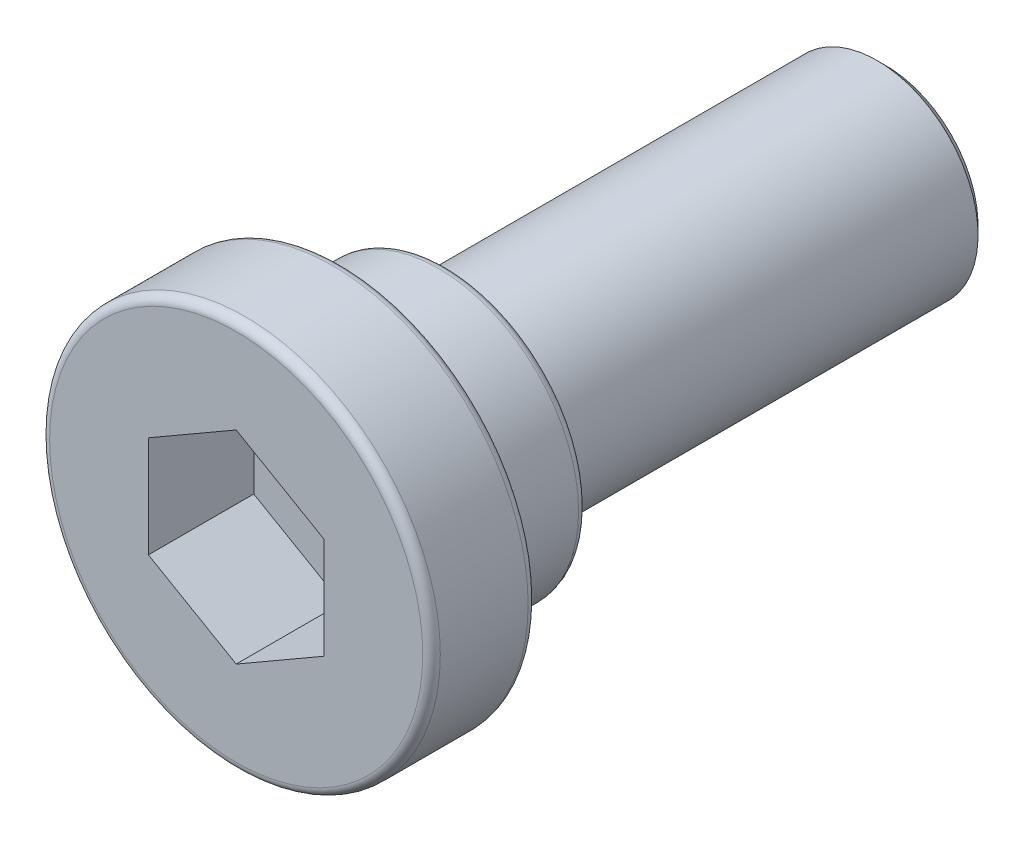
ISO-10303-21;
HEADER;
FILE_DESCRIPTION(('STEP AP214'),'2;1');
FILE_NAME('part.step','',(''),(''),'','','');
FILE_SCHEMA(('AUTOMOTIVE_DESIGN { 1 0 10303 214 1 1 1 1 }'));
ENDSEC;
DATA;
#1=APPLICATION_CONTEXT('core data for automotive mechanical design processes');
#2=APPLICATION_PROTOCOL_DEFINITION('international standard','automotive_design',2000,#1);
#3=PRODUCT_CONTEXT('',#1,'mechanical');
#4=PRODUCT('Part','Part','',(#3));
#5=PRODUCT_RELATED_PRODUCT_CATEGORY('part','',(#4));
#6=PRODUCT_DEFINITION_FORMATION('','',#4);
#7=PRODUCT_DEFINITION_CONTEXT('part definition',#1,'design');
#8=PRODUCT_DEFINITION('design','',#6,#7);
#9=PRODUCT_DEFINITION_SHAPE('','',#8);
#10=(LENGTH_UNIT() NAMED_UNIT(*) SI_UNIT(.MILLI.,.METRE.));
#11=(NAMED_UNIT(*) PLANE_ANGLE_UNIT() SI_UNIT($,.RADIAN.));
#12=(NAMED_UNIT(*) SI_UNIT($,.STERADIAN.) SOLID_ANGLE_UNIT());
#13=UNCERTAINTY_MEASURE_WITH_UNIT(LENGTH_MEASURE(1.E-05),#10,'distance_accuracy_value','');
#14=(GEOMETRIC_REPRESENTATION_CONTEXT(3) GLOBAL_UNCERTAINTY_ASSIGNED_CONTEXT((#13)) GLOBAL_UNIT_ASSIGNED_CONTEXT((#10,
#11,#12)) REPRESENTATION_CONTEXT('',''));
#15=CARTESIAN_POINT('',(0.,0.,0.));
#16=DIRECTION('',(0.,0.,1.));
#17=DIRECTION('',(1.,0.,0.));
#18=AXIS2_PLACEMENT_3D('',#15,#16,#17);
#19=CARTESIAN_POINT('',(0.,0.,6.2));
#20=DIRECTION('',(0.,0.,1.));
#21=DIRECTION('',(1.,0.,0.));
#22=AXIS2_PLACEMENT_3D('',#19,#20,#21);
#23=PLANE('',#22);
#24=DIRECTION('',(0.866025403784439,0.5,0.));
#25=VECTOR('',#24,1.);
#26=CARTESIAN_POINT('',(0.,-1.15470053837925,6.2));
#27=LINE('',#26,#25);
#28=CARTESIAN_POINT('',(0.,-1.15470053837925,6.2));
#29=VERTEX_POINT('',#28);
#30=CARTESIAN_POINT('',(1.,-0.577350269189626,6.2));
#31=VERTEX_POINT('',#30);
#32=EDGE_CURVE('E87',#29,#31,#27,.T.);
#33=ORIENTED_EDGE('',*,*,#32,.T.);
#34=DIRECTION('',(0.,1.,0.));
#35=VECTOR('',#34,1.);
#36=CARTESIAN_POINT('',(1.,-0.577350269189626,6.2));
#37=LINE('',#36,#35);
#38=CARTESIAN_POINT('',(1.,0.577350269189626,6.2));
#39=VERTEX_POINT('',#38);
#40=EDGE_CURVE('E89',#31,#39,#37,.T.);
#41=ORIENTED_EDGE('',*,*,#40,.T.);
#42=DIRECTION('',(-0.866025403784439,0.5,0.));
#43=VECTOR('',#42,1.);
#44=CARTESIAN_POINT('',(1.,0.577350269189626,6.2));
#45=LINE('',#44,#43);
#46=CARTESIAN_POINT('',(0.,1.15470053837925,6.2));
#47=VERTEX_POINT('',#46);
#48=EDGE_CURVE('E91',#39,#47,#45,.T.);
#49=ORIENTED_EDGE('',*,*,#48,.T.);
#50=DIRECTION('',(-0.866025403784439,-0.5,0.));
#51=VECTOR('',#50,1.);
#52=CARTESIAN_POINT('',(0.,1.15470053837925,6.2));
#53=LINE('',#52,#51);
#54=CARTESIAN_POINT('',(-1.,0.577350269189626,6.2));
#55=VERTEX_POINT('',#54);
#56=EDGE_CURVE('E241',#47,#55,#53,.T.);
#57=ORIENTED_EDGE('',*,*,#56,.T.);
#58=DIRECTION('',(0.,-1.,0.));
#59=VECTOR('',#58,1.);
#60=CARTESIAN_POINT('',(-1.,0.577350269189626,6.2));
#61=LINE('',#60,#59);
#62=CARTESIAN_POINT('',(-1.,-0.577350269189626,6.2));
#63=VERTEX_POINT('',#62);
#64=EDGE_CURVE('E246',#55,#63,#61,.T.);
#65=ORIENTED_EDGE('',*,*,#64,.T.);
#66=DIRECTION('',(0.866025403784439,-0.5,0.));
#67=VECTOR('',#66,1.);
#68=CARTESIAN_POINT('',(-1.,-0.577350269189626,6.2));
#69=LINE('',#68,#67);
#70=EDGE_CURVE('E250',#63,#29,#69,.T.);
#71=ORIENTED_EDGE('',*,*,#70,.T.);
#72=EDGE_LOOP('',(#33,#41,#49,#57,#65,#71));
#73=FACE_BOUND('',#72,.T.);
#74=ADVANCED_FACE('F17',(#73),#23,.T.);
#75=CARTESIAN_POINT('',(1.,0.577350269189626,6.2));
#76=DIRECTION('',(0.5,0.866025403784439,0.));
#77=DIRECTION('',(-0.866025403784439,0.5,0.));
#78=AXIS2_PLACEMENT_3D('',#75,#76,#77);
#79=PLANE('',#78);
#80=DIRECTION('',(0.,0.,1.));
#81=VECTOR('',#80,1.);
#82=CARTESIAN_POINT('',(0.,1.15470053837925,6.2));
#83=LINE('',#82,#81);
#84=CARTESIAN_POINT('',(0.,1.15470053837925,7.4));
#85=VERTEX_POINT('',#84);
#86=EDGE_CURVE('E102',#85,#47,#83,.F.);
#87=ORIENTED_EDGE('',*,*,#86,.T.);
#88=ORIENTED_EDGE('',*,*,#48,.F.);
#89=DIRECTION('',(0.,0.,1.));
#90=VECTOR('',#89,1.);
#91=CARTESIAN_POINT('',(1.,0.577350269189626,6.2));
#92=LINE('',#91,#90);
#93=CARTESIAN_POINT('',(1.,0.577350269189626,7.4));
#94=VERTEX_POINT('',#93);
#95=EDGE_CURVE('E96',#39,#94,#92,.T.);
#96=ORIENTED_EDGE('',*,*,#95,.T.);
#97=DIRECTION('',(0.866025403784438,-0.5,0.));
#98=VECTOR('',#97,1.);
#99=CARTESIAN_POINT('',(0.,1.15470053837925,7.4));
#100=LINE('',#99,#98);
#101=EDGE_CURVE('E240',#85,#94,#100,.T.);
#102=ORIENTED_EDGE('',*,*,#101,.F.);
#103=EDGE_LOOP('',(#87,#88,#96,#102));
#104=FACE_BOUND('',#103,.T.);
#105=ADVANCED_FACE('F99',(#104),#79,.F.);
#106=CARTESIAN_POINT('',(1.,-0.577350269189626,6.2));
#107=DIRECTION('',(1.,0.,0.));
#108=DIRECTION('',(0.,1.,0.));
#109=AXIS2_PLACEMENT_3D('',#106,#107,#108);
#110=PLANE('',#109);
#111=ORIENTED_EDGE('',*,*,#95,.F.);
#112=ORIENTED_EDGE('',*,*,#40,.F.);
#113=DIRECTION('',(0.,0.,1.));
#114=VECTOR('',#113,1.);
#115=CARTESIAN_POINT('',(1.,-0.577350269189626,6.2));
#116=LINE('',#115,#114);
#117=CARTESIAN_POINT('',(1.,-0.577350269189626,7.4));
#118=VERTEX_POINT('',#117);
#119=EDGE_CURVE('E110',#31,#118,#116,.T.);
#120=ORIENTED_EDGE('',*,*,#119,.T.);
#121=DIRECTION('',(0.,1.,0.));
#122=VECTOR('',#121,1.);
#123=CARTESIAN_POINT('',(1.,0.,7.4));
#124=LINE('',#123,#122);
#125=EDGE_CURVE('E107',#94,#118,#124,.F.);
#126=ORIENTED_EDGE('',*,*,#125,.F.);
#127=EDGE_LOOP('',(#111,#112,#120,#126));
#128=FACE_BOUND('',#127,.T.);
#129=ADVANCED_FACE('F105',(#128),#110,.F.);
#130=CARTESIAN_POINT('',(0.,-1.15470053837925,6.2));
#131=DIRECTION('',(0.5,-0.866025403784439,0.));
#132=DIRECTION('',(0.866025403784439,0.5,0.));
#133=AXIS2_PLACEMENT_3D('',#130,#131,#132);
#134=PLANE('',#133);
#135=ORIENTED_EDGE('',*,*,#119,.F.);
#136=ORIENTED_EDGE('',*,*,#32,.F.);
#137=DIRECTION('',(0.,0.,1.));
#138=VECTOR('',#137,1.);
#139=CARTESIAN_POINT('',(0.,-1.15470053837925,6.2));
#140=LINE('',#139,#138);
#141=CARTESIAN_POINT('',(0.,-1.15470053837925,7.4));
#142=VERTEX_POINT('',#141);
#143=EDGE_CURVE('E248',#29,#142,#140,.T.);
#144=ORIENTED_EDGE('',*,*,#143,.T.);
#145=DIRECTION('',(-0.866025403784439,-0.5,0.));
#146=VECTOR('',#145,1.);
#147=CARTESIAN_POINT('',(1.,-0.577350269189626,7.4));
#148=LINE('',#147,#146);
#149=EDGE_CURVE('E254',#118,#142,#148,.T.);
#150=ORIENTED_EDGE('',*,*,#149,.F.);
#151=EDGE_LOOP('',(#135,#136,#144,#150));
#152=FACE_BOUND('',#151,.T.);
#153=ADVANCED_FACE('F255',(#152),#134,.F.);
#154=CARTESIAN_POINT('',(-1.,-0.577350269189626,6.2));
#155=DIRECTION('',(-0.5,-0.866025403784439,0.));
#156=DIRECTION('',(0.866025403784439,-0.5,0.));
#157=AXIS2_PLACEMENT_3D('',#154,#155,#156);
#158=PLANE('',#157);
#159=ORIENTED_EDGE('',*,*,#143,.F.);
#160=ORIENTED_EDGE('',*,*,#70,.F.);
#161=DIRECTION('',(0.,0.,1.));
#162=VECTOR('',#161,1.);
#163=CARTESIAN_POINT('',(-1.,-0.577350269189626,6.2));
#164=LINE('',#163,#162);
#165=CARTESIAN_POINT('',(-1.,-0.577350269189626,7.4));
#166=VERTEX_POINT('',#165);
#167=EDGE_CURVE('E244',#63,#166,#164,.T.);
#168=ORIENTED_EDGE('',*,*,#167,.T.);
#169=DIRECTION('',(-0.866025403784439,0.5,0.));
#170=VECTOR('',#169,1.);
#171=CARTESIAN_POINT('',(0.,-1.15470053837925,7.4));
#172=LINE('',#171,#170);
#173=EDGE_CURVE('E260',#142,#166,#172,.T.);
#174=ORIENTED_EDGE('',*,*,#173,.F.);
#175=EDGE_LOOP('',(#159,#160,#168,#174));
#176=FACE_BOUND('',#175,.T.);
#177=ADVANCED_FACE('F393',(#176),#158,.F.);
#178=CARTESIAN_POINT('',(-1.,0.577350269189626,6.2));
#179=DIRECTION('',(-1.,0.,0.));
#180=DIRECTION('',(0.,-1.,0.));
#181=AXIS2_PLACEMENT_3D('',#178,#179,#180);
#182=PLANE('',#181);
#183=ORIENTED_EDGE('',*,*,#167,.F.);
#184=ORIENTED_EDGE('',*,*,#64,.F.);
#185=DIRECTION('',(0.,0.,1.));
#186=VECTOR('',#185,1.);
#187=CARTESIAN_POINT('',(-1.,0.577350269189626,6.2));
#188=LINE('',#187,#186);
#189=CARTESIAN_POINT('',(-1.,0.577350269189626,7.4));
#190=VERTEX_POINT('',#189);
#191=EDGE_CURVE('E233',#55,#190,#188,.T.);
#192=ORIENTED_EDGE('',*,*,#191,.T.);
#193=DIRECTION('',(0.,1.,0.));
#194=VECTOR('',#193,1.);
#195=CARTESIAN_POINT('',(-1.,0.,7.4));
#196=LINE('',#195,#194);
#197=EDGE_CURVE('E268',#166,#190,#196,.T.);
#198=ORIENTED_EDGE('',*,*,#197,.F.);
#199=EDGE_LOOP('',(#183,#184,#192,#198));
#200=FACE_BOUND('',#199,.T.);
#201=ADVANCED_FACE('F303',(#200),#182,.F.);
#202=CARTESIAN_POINT('',(0.,1.15470053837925,6.2));
#203=DIRECTION('',(-0.5,0.866025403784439,0.));
#204=DIRECTION('',(-0.866025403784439,-0.5,0.));
#205=AXIS2_PLACEMENT_3D('',#202,#203,#204);
#206=PLANE('',#205);
#207=ORIENTED_EDGE('',*,*,#191,.F.);
#208=ORIENTED_EDGE('',*,*,#56,.F.);
#209=ORIENTED_EDGE('',*,*,#86,.F.);
#210=DIRECTION('',(0.866025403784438,0.5,0.));
#211=VECTOR('',#210,1.);
#212=CARTESIAN_POINT('',(-1.,0.577350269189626,7.4));
#213=LINE('',#212,#211);
#214=EDGE_CURVE('E270',#190,#85,#213,.T.);
#215=ORIENTED_EDGE('',*,*,#214,.F.);
#216=EDGE_LOOP('',(#207,#208,#209,#215));
#217=FACE_BOUND('',#216,.T.);
#218=ADVANCED_FACE('F298',(#217),#206,.F.);
#219=CARTESIAN_POINT('',(0.,0.,7.4));
#220=DIRECTION('',(0.,0.,1.));
#221=DIRECTION('',(1.,0.,0.));
#222=AXIS2_PLACEMENT_3D('',#219,#220,#221);
#223=PLANE('',#222);
#224=ORIENTED_EDGE('',*,*,#197,.T.);
#225=ORIENTED_EDGE('',*,*,#214,.T.);
#226=ORIENTED_EDGE('',*,*,#101,.T.);
#227=ORIENTED_EDGE('',*,*,#125,.T.);
#228=ORIENTED_EDGE('',*,*,#149,.T.);
#229=ORIENTED_EDGE('',*,*,#173,.T.);
#230=EDGE_LOOP('',(#224,#225,#226,#227,#228,#229));
#231=FACE_BOUND('',#230,.T.);
#232=CARTESIAN_POINT('',(0.,0.,7.4));
#233=DIRECTION('',(0.,0.,-1.));
#234=DIRECTION('',(-1.,0.,0.));
#235=AXIS2_PLACEMENT_3D('',#232,#233,#234);
#236=CIRCLE('',#235,2.125);
#237=CARTESIAN_POINT('',(-2.125,0.,7.4));
#238=VERTEX_POINT('',#237);
#239=CARTESIAN_POINT('',(2.125,0.,7.4));
#240=VERTEX_POINT('',#239);
#241=EDGE_CURVE('E272',#238,#240,#236,.T.);
#242=ORIENTED_EDGE('',*,*,#241,.F.);
#243=CARTESIAN_POINT('',(0.,0.,7.4));
#244=DIRECTION('',(0.,0.,-1.));
#245=DIRECTION('',(1.,0.,0.));
#246=AXIS2_PLACEMENT_3D('',#243,#244,#245);
#247=CIRCLE('',#246,2.125);
#248=EDGE_CURVE('E212',#240,#238,#247,.T.);
#249=ORIENTED_EDGE('',*,*,#248,.F.);
#250=EDGE_LOOP('',(#242,#249));
#251=FACE_BOUND('',#250,.T.);
#252=ADVANCED_FACE('F221',(#231,#251),#223,.T.);
#253=CARTESIAN_POINT('',(0.,0.,7.3));
#254=DIRECTION('',(0.,0.,1.));
#255=DIRECTION('',(1.,0.,0.));
#256=AXIS2_PLACEMENT_3D('',#253,#254,#255);
#257=TOROIDAL_SURFACE('',#256,2.125,0.1);
#258=CARTESIAN_POINT('',(0.,0.,7.3));
#259=DIRECTION('',(0.,0.,-1.));
#260=DIRECTION('',(-1.,0.,0.));
#261=AXIS2_PLACEMENT_3D('',#258,#259,#260);
#262=CIRCLE('',#261,2.225);
#263=CARTESIAN_POINT('',(-2.225,0.,7.3));
#264=VERTEX_POINT('',#263);
#265=EDGE_CURVE('E209',#264,#264,#262,.T.);
#266=ORIENTED_EDGE('',*,*,#265,.F.);
#267=EDGE_LOOP('',(#266));
#268=FACE_BOUND('',#267,.T.);
#269=ORIENTED_EDGE('',*,*,#248,.T.);
#270=ORIENTED_EDGE('',*,*,#241,.T.);
#271=EDGE_LOOP('',(#269,#270));
#272=FACE_BOUND('',#271,.T.);
#273=ADVANCED_FACE('F216',(#268,#272),#257,.T.);
#274=CARTESIAN_POINT('',(0.,0.,7.4));
#275=DIRECTION('',(0.,0.,-1.));
#276=DIRECTION('',(-1.,0.,0.));
#277=AXIS2_PLACEMENT_3D('',#274,#275,#276);
#278=CYLINDRICAL_SURFACE('',#277,2.225);
#279=ORIENTED_EDGE('',*,*,#265,.T.);
#280=EDGE_LOOP('',(#279));
#281=FACE_BOUND('',#280,.T.);
#282=CARTESIAN_POINT('',(0.,0.,6.3));
#283=DIRECTION('',(0.,0.,1.));
#284=DIRECTION('',(1.,0.,0.));
#285=AXIS2_PLACEMENT_3D('',#282,#283,#284);
#286=CIRCLE('',#285,2.225);
#287=CARTESIAN_POINT('',(2.225,0.,6.3));
#288=VERTEX_POINT('',#287);
#289=EDGE_CURVE('E201',#288,#288,#286,.F.);
#290=ORIENTED_EDGE('',*,*,#289,.F.);
#291=EDGE_LOOP('',(#290));
#292=FACE_BOUND('',#291,.T.);
#293=ADVANCED_FACE('F220',(#281,#292),#278,.T.);
#294=CARTESIAN_POINT('',(0.,0.,6.3));
#295=DIRECTION('',(0.,0.,1.));
#296=DIRECTION('',(1.,0.,0.));
#297=AXIS2_PLACEMENT_3D('',#294,#295,#296);
#298=TOROIDAL_SURFACE('',#297,2.125,0.1);
#299=CARTESIAN_POINT('',(0.,0.,6.2));
#300=DIRECTION('',(0.,0.,1.));
#301=DIRECTION('',(1.,0.,0.));
#302=AXIS2_PLACEMENT_3D('',#299,#300,#301);
#303=CIRCLE('',#302,2.125);
#304=CARTESIAN_POINT('',(2.125,0.,6.2));
#305=VERTEX_POINT('',#304);
#306=CARTESIAN_POINT('',(-2.125,0.,6.2));
#307=VERTEX_POINT('',#306);
#308=EDGE_CURVE('E167',#305,#307,#303,.T.);
#309=ORIENTED_EDGE('',*,*,#308,.T.);
#310=CARTESIAN_POINT('',(0.,0.,6.2));
#311=DIRECTION('',(0.,0.,1.));
#312=DIRECTION('',(-1.,0.,0.));
#313=AXIS2_PLACEMENT_3D('',#310,#311,#312);
#314=CIRCLE('',#313,2.125);
#315=EDGE_CURVE('E123',#307,#305,#314,.T.);
#316=ORIENTED_EDGE('',*,*,#315,.T.);
#317=EDGE_LOOP('',(#309,#316));
#318=FACE_BOUND('',#317,.T.);
#319=ORIENTED_EDGE('',*,*,#289,.T.);
#320=EDGE_LOOP('',(#319));
#321=FACE_BOUND('',#320,.T.);
#322=ADVANCED_FACE('F181',(#318,#321),#298,.T.);
#323=CARTESIAN_POINT('',(0.,0.,6.2));
#324=DIRECTION('',(0.,0.,1.));
#325=DIRECTION('',(1.,0.,0.));
#326=AXIS2_PLACEMENT_3D('',#323,#324,#325);
#327=PLANE('',#326);
#328=CARTESIAN_POINT('',(0.,0.,6.2));
#329=DIRECTION('',(0.,0.,-1.));
#330=DIRECTION('',(-1.,0.,0.));
#331=AXIS2_PLACEMENT_3D('',#328,#329,#330);
#332=CIRCLE('',#331,1.6);
#333=CARTESIAN_POINT('',(-1.6,0.,6.2));
#334=VERTEX_POINT('',#333);
#335=EDGE_CURVE('E120',#334,#334,#332,.T.);
#336=ORIENTED_EDGE('',*,*,#335,.F.);
#337=EDGE_LOOP('',(#336));
#338=FACE_BOUND('',#337,.T.);
#339=ORIENTED_EDGE('',*,*,#308,.F.);
#340=ORIENTED_EDGE('',*,*,#315,.F.);
#341=EDGE_LOOP('',(#339,#340));
#342=FACE_BOUND('',#341,.T.);
#343=ADVANCED_FACE('F172',(#338,#342),#327,.F.);
#344=CARTESIAN_POINT('',(0.,0.,6.2));
#345=DIRECTION('',(0.,0.,-1.));
#346=DIRECTION('',(-1.,0.,0.));
#347=AXIS2_PLACEMENT_3D('',#344,#345,#346);
#348=CYLINDRICAL_SURFACE('',#347,1.6);
#349=ORIENTED_EDGE('',*,*,#335,.T.);
#350=EDGE_LOOP('',(#349));
#351=FACE_BOUND('',#350,.T.);
#352=CARTESIAN_POINT('',(0.,0.,5.1));
#353=DIRECTION('',(0.,0.,1.));
#354=DIRECTION('',(1.,0.,0.));
#355=AXIS2_PLACEMENT_3D('',#352,#353,#354);
#356=CIRCLE('',#355,1.6);
#357=CARTESIAN_POINT('',(1.6,0.,5.1));
#358=VERTEX_POINT('',#357);
#359=EDGE_CURVE('E122',#358,#358,#356,.F.);
#360=ORIENTED_EDGE('',*,*,#359,.F.);
#361=EDGE_LOOP('',(#360));
#362=FACE_BOUND('',#361,.T.);
#363=ADVANCED_FACE('F142',(#351,#362),#348,.T.);
#364=CARTESIAN_POINT('',(0.,0.,5.1));
#365=DIRECTION('',(0.,0.,1.));
#366=DIRECTION('',(1.,0.,0.));
#367=AXIS2_PLACEMENT_3D('',#364,#365,#366);
#368=TOROIDAL_SURFACE('',#367,1.5,0.1);
#369=CARTESIAN_POINT('',(0.,0.,5.));
#370=DIRECTION('',(0.,0.,1.));
#371=DIRECTION('',(1.,0.,0.));
#372=AXIS2_PLACEMENT_3D('',#369,#370,#371);
#373=CIRCLE('',#372,1.5);
#374=CARTESIAN_POINT('',(1.5,0.,5.));
#375=VERTEX_POINT('',#374);
#376=CARTESIAN_POINT('',(-1.5,0.,5.));
#377=VERTEX_POINT('',#376);
#378=EDGE_CURVE('E36',#375,#377,#373,.T.);
#379=ORIENTED_EDGE('',*,*,#378,.T.);
#380=CARTESIAN_POINT('',(0.,0.,5.));
#381=DIRECTION('',(0.,0.,1.));
#382=DIRECTION('',(-1.,0.,0.));
#383=AXIS2_PLACEMENT_3D('',#380,#381,#382);
#384=CIRCLE('',#383,1.5);
#385=EDGE_CURVE('E119',#377,#375,#384,.T.);
#386=ORIENTED_EDGE('',*,*,#385,.T.);
#387=EDGE_LOOP('',(#379,#386));
#388=FACE_BOUND('',#387,.T.);
#389=ORIENTED_EDGE('',*,*,#359,.T.);
#390=EDGE_LOOP('',(#389));
#391=FACE_BOUND('',#390,.T.);
#392=ADVANCED_FACE('F130',(#388,#391),#368,.T.);
#393=CARTESIAN_POINT('',(0.,0.,0.));
#394=DIRECTION('',(0.,0.,1.));
#395=DIRECTION('',(1.,0.,0.));
#396=AXIS2_PLACEMENT_3D('',#393,#394,#395);
#397=PLANE('',#396);
#398=CARTESIAN_POINT('',(0.,0.,-5.6843418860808E-11));
#399=DIRECTION('',(0.,0.,1.));
#400=DIRECTION('',(0.,-1.,0.));
#401=AXIS2_PLACEMENT_3D('',#398,#399,#400);
#402=CIRCLE('',#401,1.0499999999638);
#403=CARTESIAN_POINT('',(0.,-1.0499999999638,-5.68434126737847E-11));
#404=VERTEX_POINT('',#403);
#405=EDGE_CURVE('E116',#404,#404,#402,.T.);
#406=ORIENTED_EDGE('',*,*,#405,.F.);
#407=EDGE_LOOP('',(#406));
#408=FACE_BOUND('',#407,.T.);
#409=ADVANCED_FACE('F141',(#408),#397,.F.);
#410=CARTESIAN_POINT('',(0.,0.,5.));
#411=DIRECTION('',(0.,0.,1.));
#412=DIRECTION('',(1.,0.,0.));
#413=AXIS2_PLACEMENT_3D('',#410,#411,#412);
#414=PLANE('',#413);
#415=CARTESIAN_POINT('',(0.,0.,5.));
#416=DIRECTION('',(0.,0.,-1.));
#417=DIRECTION('',(-1.,0.,0.));
#418=AXIS2_PLACEMENT_3D('',#415,#416,#417);
#419=CIRCLE('',#418,1.15);
#420=CARTESIAN_POINT('',(-1.15,0.,5.));
#421=VERTEX_POINT('',#420);
#422=EDGE_CURVE('E28',#421,#421,#419,.T.);
#423=ORIENTED_EDGE('',*,*,#422,.F.);
#424=EDGE_LOOP('',(#423));
#425=FACE_BOUND('',#424,.T.);
#426=ORIENTED_EDGE('',*,*,#378,.F.);
#427=ORIENTED_EDGE('',*,*,#385,.F.);
#428=EDGE_LOOP('',(#426,#427));
#429=FACE_BOUND('',#428,.T.);
#430=ADVANCED_FACE('F313',(#425,#429),#414,.F.);
#431=CARTESIAN_POINT('',(0.,0.,0.0999999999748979));
#432=DIRECTION('',(0.,0.,1.));
#433=DIRECTION('',(0.,-1.,0.));
#434=AXIS2_PLACEMENT_3D('',#431,#432,#433);
#435=CONICAL_SURFACE('',#434,1.14999999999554,0.785398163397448);
#436=CARTESIAN_POINT('',(0.,0.,0.1));
#437=DIRECTION('',(0.,0.,-1.));
#438=DIRECTION('',(-1.,0.,0.));
#439=AXIS2_PLACEMENT_3D('',#436,#437,#438);
#440=CIRCLE('',#439,1.15);
#441=CARTESIAN_POINT('',(-1.15,0.,0.1));
#442=VERTEX_POINT('',#441);
#443=EDGE_CURVE('E11',#442,#442,#440,.F.);
#444=ORIENTED_EDGE('',*,*,#443,.F.);
#445=EDGE_LOOP('',(#444));
#446=FACE_BOUND('',#445,.T.);
#447=ORIENTED_EDGE('',*,*,#405,.T.);
#448=EDGE_LOOP('',(#447));
#449=FACE_BOUND('',#448,.T.);
#450=ADVANCED_FACE('F307',(#446,#449),#435,.T.);
#451=CARTESIAN_POINT('',(0.,0.,5.));
#452=DIRECTION('',(0.,0.,-1.));
#453=DIRECTION('',(-1.,0.,0.));
#454=AXIS2_PLACEMENT_3D('',#451,#452,#453);
#455=CYLINDRICAL_SURFACE('',#454,1.15);
#456=ORIENTED_EDGE('',*,*,#443,.T.);
#457=EDGE_LOOP('',(#456));
#458=FACE_BOUND('',#457,.T.);
#459=ORIENTED_EDGE('',*,*,#422,.T.);
#460=EDGE_LOOP('',(#459));
#461=FACE_BOUND('',#460,.T.);
#462=ADVANCED_FACE('F305',(#458,#461),#455,.T.);
#463=CLOSED_SHELL('',(#74,#105,#129,#153,#177,#201,#218,#252,#273,#293,#322,#343,#363,#392,#409,
#430,#450,#462));
#464=MANIFOLD_SOLID_BREP('B1',#463);
#465=ADVANCED_BREP_SHAPE_REPRESENTATION('',(#18,#464),#14);
#466=SHAPE_DEFINITION_REPRESENTATION(#9,#465);
ENDSEC;
END-ISO-10303-21;
